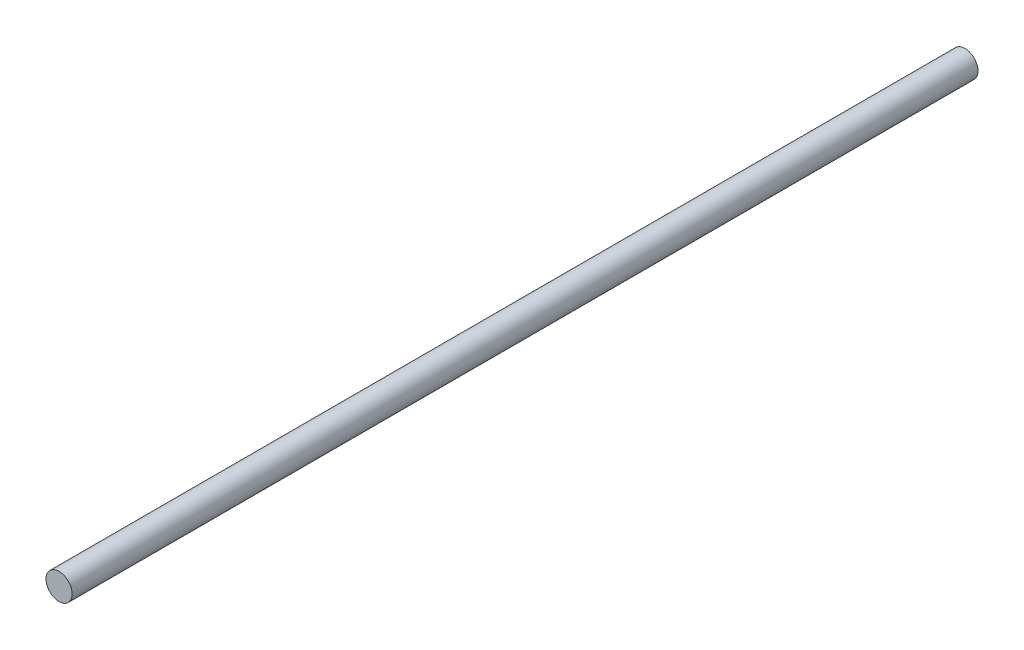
from build123d import *

# Parameters (mm, degrees)
SKETCH_1_R      = 3.175
EXTRUDE_1_DEPTH = 220


with BuildPart() as part:
    # Sketch 1 → Extrude 1 (new body)
    with BuildSketch(Plane.XY):
        Circle(SKETCH_1_R)
    extrude(amount=EXTRUDE_1_DEPTH)


solid = part.part
